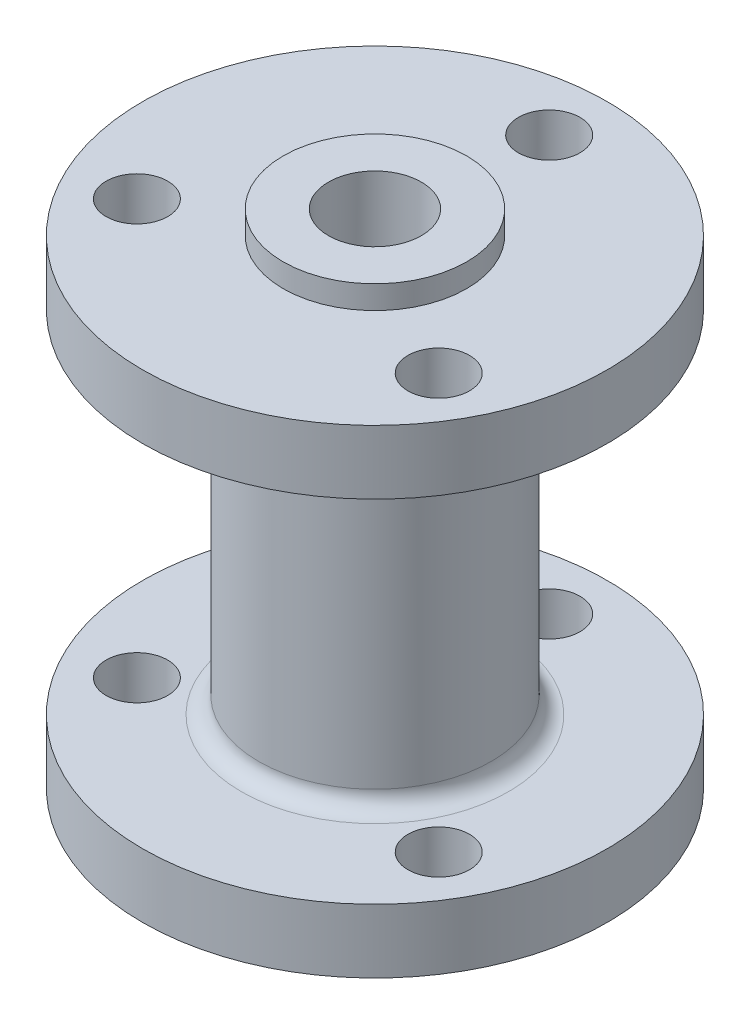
from build123d import *

# Parameters (mm, degrees)
F_8_0MM_DOWEL_HOLE1_D = 8
M5_CLEARANCE_HOLE1_D  = 5.3
CIRPATTERN1_COUNT     = 3
FILLET1_R             = 1.5


with BuildPart() as part:
    # Sketch2 → Revolve1 (revolve)
    with BuildSketch(Plane(origin=(0, 0, 0), x_dir=(0, 0, -1), z_dir=(1, 0, 0))):
        Polygon((0, 22.6), (-7.9, 22.6), (-7.9, 20.6), (-20, 20.6), (-20, 15.1), (-10, 15.1), (-10, -15.1), (-20, -15.1), (-20, -20.6), (-7.9, -20.6), (-7.9, -22.6), (0, -22.6), (0, -15.1), (-6.5, -15.1), (-6.5, 15.1), (0, 15.1), align=None)
    revolve(axis=Axis((0, 50, 0), (0, -1, 0)))

    # 8.0mm Dowel Hole1 (through all)
    with Locations(Plane(origin=(0, 22.6, 0), x_dir=(1, 0, 0), z_dir=(0, 1, 0))):
        with Locations((0, 0)):
            Hole(F_8_0MM_DOWEL_HOLE1_D / 2)

    # M5 Clearance Hole1 (through all)
    with Locations(Plane(origin=(0, 20.6, 0), x_dir=(1, 0, 0), z_dir=(0, 1, 0))):
        with Locations((0, 15)):
            m5_clearance_hole1 = Hole(M5_CLEARANCE_HOLE1_D / 2)

    # CirPattern1: M5 Clearance Hole1 ×3 about axis
    cirpattern1_axis = Axis((0, 0, 0), (0, 1, 0))
    for i in range(1, CIRPATTERN1_COUNT):
        add(m5_clearance_hole1.rotate(cirpattern1_axis, i * 360 / CIRPATTERN1_COUNT), mode=Mode.SUBTRACT)

    # Fillet1
    fillet1_edges = [part.edges().sort_by_distance(p)[0] for p in [
        (0, -15.1, -10),
        (0, 15.1, -10),
    ]]
    fillet(fillet1_edges, radius=FILLET1_R)


solid = part.part
